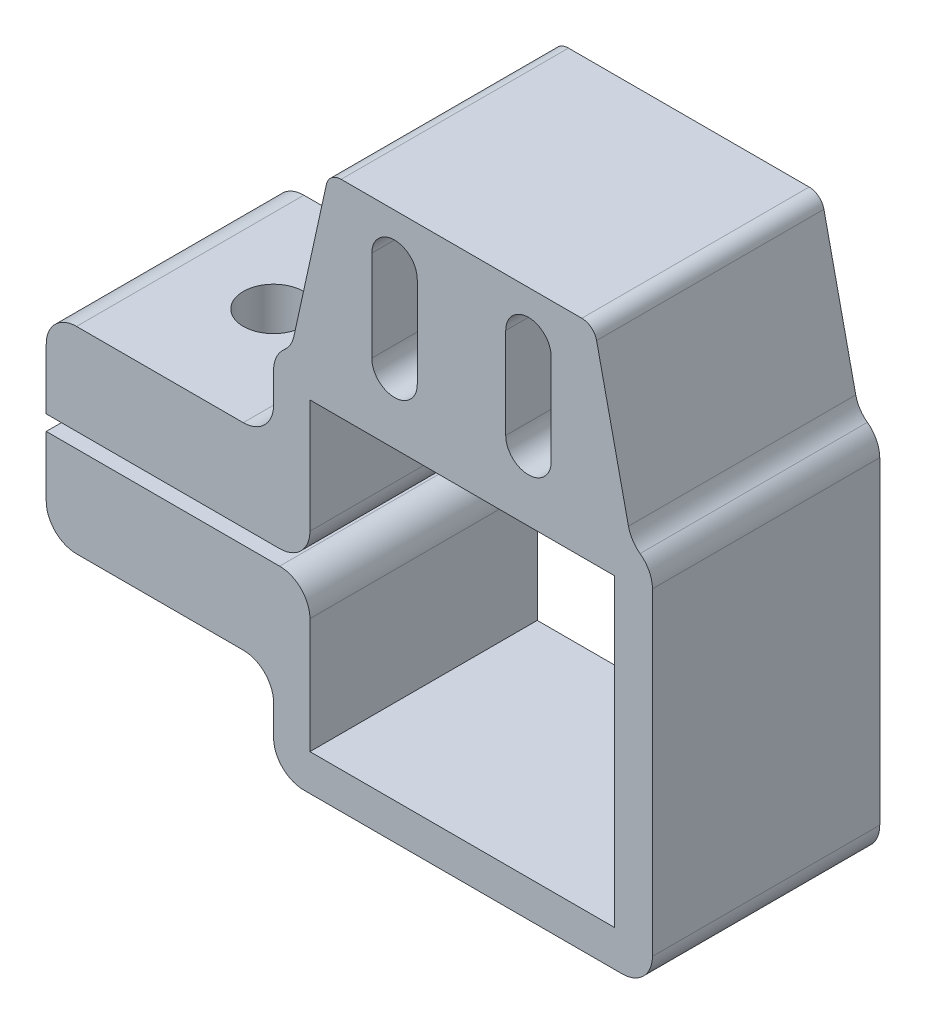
ISO-10303-21;
HEADER;
FILE_DESCRIPTION(('STEP AP214'),'2;1');
FILE_NAME('part.step','',(''),(''),'','','');
FILE_SCHEMA(('AUTOMOTIVE_DESIGN { 1 0 10303 214 1 1 1 1 }'));
ENDSEC;
DATA;
#1=APPLICATION_CONTEXT('core data for automotive mechanical design processes');
#2=APPLICATION_PROTOCOL_DEFINITION('international standard','automotive_design',2000,#1);
#3=PRODUCT_CONTEXT('',#1,'mechanical');
#4=PRODUCT('Part','Part','',(#3));
#5=PRODUCT_RELATED_PRODUCT_CATEGORY('part','',(#4));
#6=PRODUCT_DEFINITION_FORMATION('','',#4);
#7=PRODUCT_DEFINITION_CONTEXT('part definition',#1,'design');
#8=PRODUCT_DEFINITION('design','',#6,#7);
#9=PRODUCT_DEFINITION_SHAPE('','',#8);
#10=(LENGTH_UNIT() NAMED_UNIT(*) SI_UNIT(.MILLI.,.METRE.));
#11=(NAMED_UNIT(*) PLANE_ANGLE_UNIT() SI_UNIT($,.RADIAN.));
#12=(NAMED_UNIT(*) SI_UNIT($,.STERADIAN.) SOLID_ANGLE_UNIT());
#13=UNCERTAINTY_MEASURE_WITH_UNIT(LENGTH_MEASURE(1.E-05),#10,'distance_accuracy_value','');
#14=(GEOMETRIC_REPRESENTATION_CONTEXT(3) GLOBAL_UNCERTAINTY_ASSIGNED_CONTEXT((#13)) GLOBAL_UNIT_ASSIGNED_CONTEXT((#10,
#11,#12)) REPRESENTATION_CONTEXT('',''));
#15=CARTESIAN_POINT('',(0.,0.,0.));
#16=DIRECTION('',(0.,0.,1.));
#17=DIRECTION('',(1.,0.,0.));
#18=AXIS2_PLACEMENT_3D('',#15,#16,#17);
#19=CARTESIAN_POINT('',(215.342156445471,5.19858037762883,15.));
#20=DIRECTION('',(0.,0.,1.));
#21=DIRECTION('',(1.,0.,0.));
#22=AXIS2_PLACEMENT_3D('',#19,#20,#21);
#23=PLANE('',#22);
#24=DIRECTION('',(0.,-1.,0.));
#25=VECTOR('',#24,1.);
#26=CARTESIAN_POINT('',(221.423521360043,23.1264850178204,15.));
#27=LINE('',#26,#25);
#28=CARTESIAN_POINT('',(221.423521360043,23.1264850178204,15.));
#29=VERTEX_POINT('',#28);
#30=CARTESIAN_POINT('',(221.423521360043,17.1264850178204,15.));
#31=VERTEX_POINT('',#30);
#32=EDGE_CURVE('E335',#29,#31,#27,.T.);
#33=ORIENTED_EDGE('',*,*,#32,.F.);
#34=CARTESIAN_POINT('',(222.923521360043,23.1264850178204,15.));
#35=DIRECTION('',(0.,0.,1.));
#36=DIRECTION('',(1.,0.,0.));
#37=AXIS2_PLACEMENT_3D('',#34,#35,#36);
#38=CIRCLE('',#37,1.5);
#39=CARTESIAN_POINT('',(224.423521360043,23.1264850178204,15.));
#40=VERTEX_POINT('',#39);
#41=EDGE_CURVE('E333',#40,#29,#38,.T.);
#42=ORIENTED_EDGE('',*,*,#41,.F.);
#43=DIRECTION('',(0.,1.,0.));
#44=VECTOR('',#43,1.);
#45=CARTESIAN_POINT('',(224.423521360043,23.1264850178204,15.));
#46=LINE('',#45,#44);
#47=CARTESIAN_POINT('',(224.423521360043,17.1264850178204,15.));
#48=VERTEX_POINT('',#47);
#49=EDGE_CURVE('E341',#48,#40,#46,.T.);
#50=ORIENTED_EDGE('',*,*,#49,.F.);
#51=CARTESIAN_POINT('',(222.923521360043,17.1264850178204,15.));
#52=DIRECTION('',(0.,0.,1.));
#53=DIRECTION('',(1.,0.,0.));
#54=AXIS2_PLACEMENT_3D('',#51,#52,#53);
#55=CIRCLE('',#54,1.5);
#56=EDGE_CURVE('E338',#31,#48,#55,.T.);
#57=ORIENTED_EDGE('',*,*,#56,.F.);
#58=EDGE_LOOP('',(#33,#42,#50,#57));
#59=FACE_BOUND('',#58,.T.);
#60=DIRECTION('',(0.,1.,0.));
#61=VECTOR('',#60,1.);
#62=CARTESIAN_POINT('',(217.342156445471,0.198580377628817,15.));
#63=LINE('',#62,#61);
#64=CARTESIAN_POINT('',(217.342156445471,-7.40141962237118,15.));
#65=VERTEX_POINT('',#64);
#66=CARTESIAN_POINT('',(217.342156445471,0.198580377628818,15.));
#67=VERTEX_POINT('',#66);
#68=EDGE_CURVE('E364',#65,#67,#63,.T.);
#69=ORIENTED_EDGE('',*,*,#68,.T.);
#70=CARTESIAN_POINT('',(215.342156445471,0.198580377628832,15.));
#71=DIRECTION('',(0.,0.,1.));
#72=DIRECTION('',(1.,0.,0.));
#73=AXIS2_PLACEMENT_3D('',#70,#71,#72);
#74=CIRCLE('',#73,2.);
#75=CARTESIAN_POINT('',(215.342156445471,2.19858037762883,15.));
#76=VERTEX_POINT('',#75);
#77=EDGE_CURVE('E367',#67,#76,#74,.T.);
#78=ORIENTED_EDGE('',*,*,#77,.T.);
#79=DIRECTION('',(-1.,0.,0.));
#80=VECTOR('',#79,1.);
#81=CARTESIAN_POINT('',(214.942156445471,2.19858037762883,15.));
#82=LINE('',#81,#80);
#83=CARTESIAN_POINT('',(199.942156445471,2.19858037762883,15.));
#84=VERTEX_POINT('',#83);
#85=EDGE_CURVE('E370',#76,#84,#82,.T.);
#86=ORIENTED_EDGE('',*,*,#85,.T.);
#87=DIRECTION('',(0.,-1.,0.));
#88=VECTOR('',#87,1.);
#89=CARTESIAN_POINT('',(199.942156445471,2.19858037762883,15.));
#90=LINE('',#89,#88);
#91=CARTESIAN_POINT('',(199.942156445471,-1.80141962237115,15.));
#92=VERTEX_POINT('',#91);
#93=EDGE_CURVE('E372',#84,#92,#90,.T.);
#94=ORIENTED_EDGE('',*,*,#93,.T.);
#95=CARTESIAN_POINT('',(201.942156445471,-1.80141962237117,15.));
#96=DIRECTION('',(0.,0.,1.));
#97=DIRECTION('',(-1.,0.,0.));
#98=AXIS2_PLACEMENT_3D('',#95,#96,#97);
#99=CIRCLE('',#98,2.);
#100=CARTESIAN_POINT('',(201.942156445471,-3.80141962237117,15.));
#101=VERTEX_POINT('',#100);
#102=EDGE_CURVE('E374',#92,#101,#99,.T.);
#103=ORIENTED_EDGE('',*,*,#102,.T.);
#104=DIRECTION('',(1.,0.,0.));
#105=VECTOR('',#104,1.);
#106=CARTESIAN_POINT('',(201.942156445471,-3.80141962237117,15.));
#107=LINE('',#106,#105);
#108=CARTESIAN_POINT('',(212.942156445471,-3.80141962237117,15.));
#109=VERTEX_POINT('',#108);
#110=EDGE_CURVE('E376',#101,#109,#107,.T.);
#111=ORIENTED_EDGE('',*,*,#110,.T.);
#112=CARTESIAN_POINT('',(212.942156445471,-5.80141962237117,15.));
#113=DIRECTION('',(0.,0.,-1.));
#114=DIRECTION('',(1.,0.,0.));
#115=AXIS2_PLACEMENT_3D('',#112,#113,#114);
#116=CIRCLE('',#115,2.);
#117=CARTESIAN_POINT('',(214.942156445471,-5.80141962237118,15.));
#118=VERTEX_POINT('',#117);
#119=EDGE_CURVE('E378',#109,#118,#116,.T.);
#120=ORIENTED_EDGE('',*,*,#119,.T.);
#121=DIRECTION('',(0.,-1.,0.));
#122=VECTOR('',#121,1.);
#123=CARTESIAN_POINT('',(214.942156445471,-7.80141962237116,15.));
#124=LINE('',#123,#122);
#125=CARTESIAN_POINT('',(214.942156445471,-7.80141962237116,15.));
#126=VERTEX_POINT('',#125);
#127=EDGE_CURVE('E380',#118,#126,#124,.T.);
#128=ORIENTED_EDGE('',*,*,#127,.T.);
#129=CARTESIAN_POINT('',(216.942156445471,-7.80141962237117,15.));
#130=DIRECTION('',(0.,0.,1.));
#131=DIRECTION('',(-1.,0.,0.));
#132=AXIS2_PLACEMENT_3D('',#129,#130,#131);
#133=CIRCLE('',#132,2.);
#134=CARTESIAN_POINT('',(216.942156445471,-9.80141962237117,15.));
#135=VERTEX_POINT('',#134);
#136=EDGE_CURVE('E382',#126,#135,#133,.T.);
#137=ORIENTED_EDGE('',*,*,#136,.T.);
#138=DIRECTION('',(1.,0.,0.));
#139=VECTOR('',#138,1.);
#140=CARTESIAN_POINT('',(237.942156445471,-9.80141962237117,15.));
#141=LINE('',#140,#139);
#142=CARTESIAN_POINT('',(237.942156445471,-9.80141962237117,15.));
#143=VERTEX_POINT('',#142);
#144=EDGE_CURVE('E384',#135,#143,#141,.T.);
#145=ORIENTED_EDGE('',*,*,#144,.T.);
#146=CARTESIAN_POINT('',(237.942156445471,-7.80141962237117,15.));
#147=DIRECTION('',(0.,0.,1.));
#148=DIRECTION('',(-1.,0.,0.));
#149=AXIS2_PLACEMENT_3D('',#146,#147,#148);
#150=CIRCLE('',#149,2.);
#151=CARTESIAN_POINT('',(239.942156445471,-7.80141962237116,15.));
#152=VERTEX_POINT('',#151);
#153=EDGE_CURVE('E386',#143,#152,#150,.T.);
#154=ORIENTED_EDGE('',*,*,#153,.T.);
#155=DIRECTION('',(0.,1.,0.));
#156=VECTOR('',#155,1.);
#157=CARTESIAN_POINT('',(239.942156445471,13.1985803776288,15.));
#158=LINE('',#157,#156);
#159=CARTESIAN_POINT('',(239.942156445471,13.1985803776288,15.));
#160=VERTEX_POINT('',#159);
#161=EDGE_CURVE('E388',#152,#160,#158,.T.);
#162=ORIENTED_EDGE('',*,*,#161,.T.);
#163=CARTESIAN_POINT('',(237.942156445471,13.1985803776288,15.));
#164=DIRECTION('',(0.,0.,1.));
#165=DIRECTION('',(-1.,0.,0.));
#166=AXIS2_PLACEMENT_3D('',#163,#164,#165);
#167=CIRCLE('',#166,2.00000000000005);
#168=CARTESIAN_POINT('',(239.127299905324,14.8096157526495,15.));
#169=VERTEX_POINT('',#168);
#170=EDGE_CURVE('E390',#160,#169,#167,.T.);
#171=ORIENTED_EDGE('',*,*,#170,.T.);
#172=CARTESIAN_POINT('',(240.312443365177,16.4206511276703,15.));
#173=DIRECTION('',(0.,0.,-1.));
#174=DIRECTION('',(-1.,0.,0.));
#175=AXIS2_PLACEMENT_3D('',#172,#173,#174);
#176=CIRCLE('',#175,1.99999999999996);
#177=CARTESIAN_POINT('',(238.359049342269,15.9914055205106,15.));
#178=VERTEX_POINT('',#177);
#179=EDGE_CURVE('E392',#169,#178,#176,.T.);
#180=ORIENTED_EDGE('',*,*,#179,.T.);
#181=DIRECTION('',(-0.214622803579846,0.97669701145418,0.));
#182=VECTOR('',#181,1.);
#183=CARTESIAN_POINT('',(238.359049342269,15.9914055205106,15.));
#184=LINE('',#183,#182);
#185=CARTESIAN_POINT('',(236.258581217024,25.5501332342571,15.));
#186=VERTEX_POINT('',#185);
#187=EDGE_CURVE('E394',#178,#186,#184,.T.);
#188=ORIENTED_EDGE('',*,*,#187,.T.);
#189=CARTESIAN_POINT('',(235.28188420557,25.3355104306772,15.));
#190=DIRECTION('',(0.,0.,1.));
#191=DIRECTION('',(1.,0.,0.));
#192=AXIS2_PLACEMENT_3D('',#189,#190,#191);
#193=CIRCLE('',#192,0.999999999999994);
#194=CARTESIAN_POINT('',(235.28188420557,26.3355104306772,15.));
#195=VERTEX_POINT('',#194);
#196=EDGE_CURVE('E396',#186,#195,#193,.T.);
#197=ORIENTED_EDGE('',*,*,#196,.T.);
#198=DIRECTION('',(-1.,0.,0.));
#199=VECTOR('',#198,1.);
#200=CARTESIAN_POINT('',(219.402428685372,26.3355104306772,15.));
#201=LINE('',#200,#199);
#202=CARTESIAN_POINT('',(219.402428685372,26.3355104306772,15.));
#203=VERTEX_POINT('',#202);
#204=EDGE_CURVE('E398',#195,#203,#201,.T.);
#205=ORIENTED_EDGE('',*,*,#204,.T.);
#206=CARTESIAN_POINT('',(219.402428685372,25.3355104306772,15.));
#207=DIRECTION('',(0.,0.,1.));
#208=DIRECTION('',(1.,0.,0.));
#209=AXIS2_PLACEMENT_3D('',#206,#207,#208);
#210=CIRCLE('',#209,0.999999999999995);
#211=CARTESIAN_POINT('',(218.425731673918,25.5501332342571,15.));
#212=VERTEX_POINT('',#211);
#213=EDGE_CURVE('E400',#203,#212,#210,.T.);
#214=ORIENTED_EDGE('',*,*,#213,.T.);
#215=DIRECTION('',(-0.214622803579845,-0.97669701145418,0.));
#216=VECTOR('',#215,1.);
#217=CARTESIAN_POINT('',(216.282787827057,15.7981086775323,15.));
#218=LINE('',#217,#216);
#219=CARTESIAN_POINT('',(216.282787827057,15.7981086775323,15.));
#220=VERTEX_POINT('',#219);
#221=EDGE_CURVE('E402',#212,#220,#218,.T.);
#222=ORIENTED_EDGE('',*,*,#221,.T.);
#223=CARTESIAN_POINT('',(214.329393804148,16.227354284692,15.));
#224=DIRECTION('',(0.,0.,-1.));
#225=DIRECTION('',(1.,0.,0.));
#226=AXIS2_PLACEMENT_3D('',#223,#224,#225);
#227=CIRCLE('',#226,2.00000000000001);
#228=CARTESIAN_POINT('',(215.63577512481,14.7129673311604,15.));
#229=VERTEX_POINT('',#228);
#230=EDGE_CURVE('E404',#220,#229,#227,.T.);
#231=ORIENTED_EDGE('',*,*,#230,.T.);
#232=CARTESIAN_POINT('',(216.942156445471,13.1985803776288,15.));
#233=DIRECTION('',(0.,0.,1.));
#234=DIRECTION('',(-1.,0.,0.));
#235=AXIS2_PLACEMENT_3D('',#232,#233,#234);
#236=CIRCLE('',#235,2.);
#237=CARTESIAN_POINT('',(214.942156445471,13.1985803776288,15.));
#238=VERTEX_POINT('',#237);
#239=EDGE_CURVE('E406',#229,#238,#236,.T.);
#240=ORIENTED_EDGE('',*,*,#239,.T.);
#241=DIRECTION('',(0.,-1.,0.));
#242=VECTOR('',#241,1.);
#243=CARTESIAN_POINT('',(214.942156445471,11.1985803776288,15.));
#244=LINE('',#243,#242);
#245=CARTESIAN_POINT('',(214.942156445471,11.1985803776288,15.));
#246=VERTEX_POINT('',#245);
#247=EDGE_CURVE('E408',#238,#246,#244,.T.);
#248=ORIENTED_EDGE('',*,*,#247,.T.);
#249=CARTESIAN_POINT('',(212.942156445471,11.1985803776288,15.));
#250=DIRECTION('',(0.,0.,-1.));
#251=DIRECTION('',(-1.,0.,0.));
#252=AXIS2_PLACEMENT_3D('',#249,#250,#251);
#253=CIRCLE('',#252,2.);
#254=CARTESIAN_POINT('',(212.942156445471,9.19858037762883,15.));
#255=VERTEX_POINT('',#254);
#256=EDGE_CURVE('E410',#246,#255,#253,.T.);
#257=ORIENTED_EDGE('',*,*,#256,.T.);
#258=DIRECTION('',(-1.,0.,0.));
#259=VECTOR('',#258,1.);
#260=CARTESIAN_POINT('',(212.942156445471,9.19858037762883,15.));
#261=LINE('',#260,#259);
#262=CARTESIAN_POINT('',(201.942156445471,9.19858037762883,15.));
#263=VERTEX_POINT('',#262);
#264=EDGE_CURVE('E412',#255,#263,#261,.T.);
#265=ORIENTED_EDGE('',*,*,#264,.T.);
#266=CARTESIAN_POINT('',(201.942156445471,7.19858037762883,15.));
#267=DIRECTION('',(0.,0.,1.));
#268=DIRECTION('',(1.,0.,0.));
#269=AXIS2_PLACEMENT_3D('',#266,#267,#268);
#270=CIRCLE('',#269,2.);
#271=CARTESIAN_POINT('',(199.942156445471,7.19858037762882,15.));
#272=VERTEX_POINT('',#271);
#273=EDGE_CURVE('E414',#263,#272,#270,.T.);
#274=ORIENTED_EDGE('',*,*,#273,.T.);
#275=DIRECTION('',(0.,-1.,0.));
#276=VECTOR('',#275,1.);
#277=CARTESIAN_POINT('',(199.942156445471,7.19858037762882,15.));
#278=LINE('',#277,#276);
#279=CARTESIAN_POINT('',(199.942156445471,3.19901627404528,15.));
#280=VERTEX_POINT('',#279);
#281=EDGE_CURVE('E416',#272,#280,#278,.T.);
#282=ORIENTED_EDGE('',*,*,#281,.T.);
#283=DIRECTION('',(0.999999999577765,-2.90597610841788E-05,0.));
#284=VECTOR('',#283,1.);
#285=CARTESIAN_POINT('',(199.942156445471,3.19901627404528,15.));
#286=LINE('',#285,#284);
#287=CARTESIAN_POINT('',(214.942156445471,3.19858037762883,15.));
#288=VERTEX_POINT('',#287);
#289=EDGE_CURVE('E418',#280,#288,#286,.T.);
#290=ORIENTED_EDGE('',*,*,#289,.T.);
#291=DIRECTION('',(1.,0.,0.));
#292=VECTOR('',#291,1.);
#293=CARTESIAN_POINT('',(214.942156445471,3.19858037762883,15.));
#294=LINE('',#293,#292);
#295=CARTESIAN_POINT('',(215.342156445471,3.19858037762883,15.));
#296=VERTEX_POINT('',#295);
#297=EDGE_CURVE('E420',#288,#296,#294,.T.);
#298=ORIENTED_EDGE('',*,*,#297,.T.);
#299=CARTESIAN_POINT('',(215.342156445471,5.19858037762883,15.));
#300=DIRECTION('',(0.,0.,1.));
#301=DIRECTION('',(1.,0.,0.));
#302=AXIS2_PLACEMENT_3D('',#299,#300,#301);
#303=CIRCLE('',#302,2.);
#304=CARTESIAN_POINT('',(217.342156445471,5.19858037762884,15.));
#305=VERTEX_POINT('',#304);
#306=EDGE_CURVE('E422',#296,#305,#303,.T.);
#307=ORIENTED_EDGE('',*,*,#306,.T.);
#308=DIRECTION('',(0.,1.,0.));
#309=VECTOR('',#308,1.);
#310=CARTESIAN_POINT('',(217.342156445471,12.6985803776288,15.));
#311=LINE('',#310,#309);
#312=CARTESIAN_POINT('',(217.342156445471,12.6985803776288,15.));
#313=VERTEX_POINT('',#312);
#314=EDGE_CURVE('E424',#305,#313,#311,.T.);
#315=ORIENTED_EDGE('',*,*,#314,.T.);
#316=DIRECTION('',(1.,0.,0.));
#317=VECTOR('',#316,1.);
#318=CARTESIAN_POINT('',(237.442156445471,12.6985803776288,15.));
#319=LINE('',#318,#317);
#320=CARTESIAN_POINT('',(237.442156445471,12.6985803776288,15.));
#321=VERTEX_POINT('',#320);
#322=EDGE_CURVE('E426',#313,#321,#319,.T.);
#323=ORIENTED_EDGE('',*,*,#322,.T.);
#324=DIRECTION('',(0.,-1.,0.));
#325=VECTOR('',#324,1.);
#326=CARTESIAN_POINT('',(237.442156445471,-7.40141962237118,15.));
#327=LINE('',#326,#325);
#328=CARTESIAN_POINT('',(237.442156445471,-7.40141962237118,15.));
#329=VERTEX_POINT('',#328);
#330=EDGE_CURVE('E428',#321,#329,#327,.T.);
#331=ORIENTED_EDGE('',*,*,#330,.T.);
#332=DIRECTION('',(-1.,0.,0.));
#333=VECTOR('',#332,1.);
#334=CARTESIAN_POINT('',(217.342156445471,-7.40141962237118,15.));
#335=LINE('',#334,#333);
#336=EDGE_CURVE('E430',#329,#65,#335,.T.);
#337=ORIENTED_EDGE('',*,*,#336,.T.);
#338=EDGE_LOOP('',(#69,#78,#86,#94,#103,#111,#120,#128,#137,#145,#154,#162,#171,#180,#188,#197,
#205,#214,#222,#231,#240,#248,#257,#265,#274,#282,#290,#298,#307,#315,#323,#331,#337));
#339=FACE_BOUND('',#338,.T.);
#340=DIRECTION('',(0.,-1.,0.));
#341=VECTOR('',#340,1.);
#342=CARTESIAN_POINT('',(230.2607915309,23.1264850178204,15.));
#343=LINE('',#342,#341);
#344=CARTESIAN_POINT('',(230.2607915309,23.1264850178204,15.));
#345=VERTEX_POINT('',#344);
#346=CARTESIAN_POINT('',(230.2607915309,17.1264850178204,15.));
#347=VERTEX_POINT('',#346);
#348=EDGE_CURVE('E303',#345,#347,#343,.T.);
#349=ORIENTED_EDGE('',*,*,#348,.F.);
#350=CARTESIAN_POINT('',(231.7607915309,23.1264850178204,15.));
#351=DIRECTION('',(0.,0.,1.));
#352=DIRECTION('',(-1.,0.,0.));
#353=AXIS2_PLACEMENT_3D('',#350,#351,#352);
#354=CIRCLE('',#353,1.5);
#355=CARTESIAN_POINT('',(233.2607915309,23.1264850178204,15.));
#356=VERTEX_POINT('',#355);
#357=EDGE_CURVE('E295',#356,#345,#354,.T.);
#358=ORIENTED_EDGE('',*,*,#357,.F.);
#359=DIRECTION('',(0.,1.,0.));
#360=VECTOR('',#359,1.);
#361=CARTESIAN_POINT('',(233.2607915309,23.1264850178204,15.));
#362=LINE('',#361,#360);
#363=CARTESIAN_POINT('',(233.2607915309,17.1264850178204,15.));
#364=VERTEX_POINT('',#363);
#365=EDGE_CURVE('E317',#364,#356,#362,.T.);
#366=ORIENTED_EDGE('',*,*,#365,.F.);
#367=CARTESIAN_POINT('',(231.7607915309,17.1264850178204,15.));
#368=DIRECTION('',(0.,0.,1.));
#369=DIRECTION('',(-1.,0.,0.));
#370=AXIS2_PLACEMENT_3D('',#367,#368,#369);
#371=CIRCLE('',#370,1.5);
#372=EDGE_CURVE('E315',#347,#364,#371,.T.);
#373=ORIENTED_EDGE('',*,*,#372,.F.);
#374=EDGE_LOOP('',(#349,#358,#366,#373));
#375=FACE_BOUND('',#374,.T.);
#376=ADVANCED_FACE('F31',(#59,#339,#375),#23,.T.);
#377=CARTESIAN_POINT('',(215.342156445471,5.19858037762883,0.));
#378=DIRECTION('',(0.,0.,1.));
#379=DIRECTION('',(1.,0.,0.));
#380=AXIS2_PLACEMENT_3D('',#377,#378,#379);
#381=PLANE('',#380);
#382=CARTESIAN_POINT('',(222.923521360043,23.1264850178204,0.));
#383=DIRECTION('',(0.,0.,1.));
#384=DIRECTION('',(1.,0.,0.));
#385=AXIS2_PLACEMENT_3D('',#382,#383,#384);
#386=CIRCLE('',#385,1.5);
#387=CARTESIAN_POINT('',(224.423521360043,23.1264850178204,0.));
#388=VERTEX_POINT('',#387);
#389=CARTESIAN_POINT('',(221.423521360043,23.1264850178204,0.));
#390=VERTEX_POINT('',#389);
#391=EDGE_CURVE('E311',#388,#390,#386,.T.);
#392=ORIENTED_EDGE('',*,*,#391,.T.);
#393=DIRECTION('',(0.,-1.,0.));
#394=VECTOR('',#393,1.);
#395=CARTESIAN_POINT('',(221.423521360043,23.1264850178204,0.));
#396=LINE('',#395,#394);
#397=CARTESIAN_POINT('',(221.423521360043,17.1264850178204,0.));
#398=VERTEX_POINT('',#397);
#399=EDGE_CURVE('E346',#390,#398,#396,.T.);
#400=ORIENTED_EDGE('',*,*,#399,.T.);
#401=CARTESIAN_POINT('',(222.923521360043,17.1264850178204,0.));
#402=DIRECTION('',(0.,0.,1.));
#403=DIRECTION('',(1.,0.,0.));
#404=AXIS2_PLACEMENT_3D('',#401,#402,#403);
#405=CIRCLE('',#404,1.5);
#406=CARTESIAN_POINT('',(224.423521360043,17.1264850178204,0.));
#407=VERTEX_POINT('',#406);
#408=EDGE_CURVE('E349',#398,#407,#405,.T.);
#409=ORIENTED_EDGE('',*,*,#408,.T.);
#410=DIRECTION('',(0.,1.,0.));
#411=VECTOR('',#410,1.);
#412=CARTESIAN_POINT('',(224.423521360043,23.1264850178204,0.));
#413=LINE('',#412,#411);
#414=EDGE_CURVE('E336',#407,#388,#413,.T.);
#415=ORIENTED_EDGE('',*,*,#414,.T.);
#416=EDGE_LOOP('',(#392,#400,#409,#415));
#417=FACE_BOUND('',#416,.T.);
#418=DIRECTION('',(0.,1.,0.));
#419=VECTOR('',#418,1.);
#420=CARTESIAN_POINT('',(217.342156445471,0.198580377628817,0.));
#421=LINE('',#420,#419);
#422=CARTESIAN_POINT('',(217.342156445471,-7.40141962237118,0.));
#423=VERTEX_POINT('',#422);
#424=CARTESIAN_POINT('',(217.342156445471,0.198580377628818,0.));
#425=VERTEX_POINT('',#424);
#426=EDGE_CURVE('E363',#423,#425,#421,.T.);
#427=ORIENTED_EDGE('',*,*,#426,.F.);
#428=DIRECTION('',(-1.,0.,0.));
#429=VECTOR('',#428,1.);
#430=CARTESIAN_POINT('',(217.342156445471,-7.40141962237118,0.));
#431=LINE('',#430,#429);
#432=CARTESIAN_POINT('',(237.442156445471,-7.40141962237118,0.));
#433=VERTEX_POINT('',#432);
#434=EDGE_CURVE('E368',#433,#423,#431,.T.);
#435=ORIENTED_EDGE('',*,*,#434,.F.);
#436=DIRECTION('',(0.,-1.,0.));
#437=VECTOR('',#436,1.);
#438=CARTESIAN_POINT('',(237.442156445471,-7.40141962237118,0.));
#439=LINE('',#438,#437);
#440=CARTESIAN_POINT('',(237.442156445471,12.6985803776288,0.));
#441=VERTEX_POINT('',#440);
#442=EDGE_CURVE('E496',#441,#433,#439,.T.);
#443=ORIENTED_EDGE('',*,*,#442,.F.);
#444=DIRECTION('',(1.,0.,0.));
#445=VECTOR('',#444,1.);
#446=CARTESIAN_POINT('',(237.442156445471,12.6985803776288,0.));
#447=LINE('',#446,#445);
#448=CARTESIAN_POINT('',(217.342156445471,12.6985803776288,0.));
#449=VERTEX_POINT('',#448);
#450=EDGE_CURVE('E494',#449,#441,#447,.T.);
#451=ORIENTED_EDGE('',*,*,#450,.F.);
#452=DIRECTION('',(0.,1.,0.));
#453=VECTOR('',#452,1.);
#454=CARTESIAN_POINT('',(217.342156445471,12.6985803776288,0.));
#455=LINE('',#454,#453);
#456=CARTESIAN_POINT('',(217.342156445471,5.19858037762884,0.));
#457=VERTEX_POINT('',#456);
#458=EDGE_CURVE('E492',#457,#449,#455,.T.);
#459=ORIENTED_EDGE('',*,*,#458,.F.);
#460=CARTESIAN_POINT('',(215.342156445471,5.19858037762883,0.));
#461=DIRECTION('',(0.,0.,1.));
#462=DIRECTION('',(1.,0.,0.));
#463=AXIS2_PLACEMENT_3D('',#460,#461,#462);
#464=CIRCLE('',#463,2.);
#465=CARTESIAN_POINT('',(215.342156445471,3.19858037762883,0.));
#466=VERTEX_POINT('',#465);
#467=EDGE_CURVE('E490',#466,#457,#464,.T.);
#468=ORIENTED_EDGE('',*,*,#467,.F.);
#469=DIRECTION('',(1.,0.,0.));
#470=VECTOR('',#469,1.);
#471=CARTESIAN_POINT('',(214.942156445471,3.19858037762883,0.));
#472=LINE('',#471,#470);
#473=CARTESIAN_POINT('',(214.942156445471,3.19858037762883,0.));
#474=VERTEX_POINT('',#473);
#475=EDGE_CURVE('E488',#474,#466,#472,.T.);
#476=ORIENTED_EDGE('',*,*,#475,.F.);
#477=DIRECTION('',(0.999999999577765,-2.90597610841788E-05,0.));
#478=VECTOR('',#477,1.);
#479=CARTESIAN_POINT('',(199.942156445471,3.19901627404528,0.));
#480=LINE('',#479,#478);
#481=CARTESIAN_POINT('',(199.942156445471,3.19901627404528,0.));
#482=VERTEX_POINT('',#481);
#483=EDGE_CURVE('E486',#482,#474,#480,.T.);
#484=ORIENTED_EDGE('',*,*,#483,.F.);
#485=DIRECTION('',(0.,-1.,0.));
#486=VECTOR('',#485,1.);
#487=CARTESIAN_POINT('',(199.942156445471,7.19858037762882,0.));
#488=LINE('',#487,#486);
#489=CARTESIAN_POINT('',(199.942156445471,7.19858037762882,0.));
#490=VERTEX_POINT('',#489);
#491=EDGE_CURVE('E484',#490,#482,#488,.T.);
#492=ORIENTED_EDGE('',*,*,#491,.F.);
#493=CARTESIAN_POINT('',(201.942156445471,7.19858037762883,0.));
#494=DIRECTION('',(0.,0.,1.));
#495=DIRECTION('',(1.,0.,0.));
#496=AXIS2_PLACEMENT_3D('',#493,#494,#495);
#497=CIRCLE('',#496,2.);
#498=CARTESIAN_POINT('',(201.942156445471,9.19858037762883,0.));
#499=VERTEX_POINT('',#498);
#500=EDGE_CURVE('E482',#499,#490,#497,.T.);
#501=ORIENTED_EDGE('',*,*,#500,.F.);
#502=DIRECTION('',(-1.,0.,0.));
#503=VECTOR('',#502,1.);
#504=CARTESIAN_POINT('',(212.942156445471,9.19858037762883,0.));
#505=LINE('',#504,#503);
#506=CARTESIAN_POINT('',(212.942156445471,9.19858037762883,0.));
#507=VERTEX_POINT('',#506);
#508=EDGE_CURVE('E480',#507,#499,#505,.T.);
#509=ORIENTED_EDGE('',*,*,#508,.F.);
#510=CARTESIAN_POINT('',(212.942156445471,11.1985803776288,0.));
#511=DIRECTION('',(0.,0.,-1.));
#512=DIRECTION('',(-1.,0.,0.));
#513=AXIS2_PLACEMENT_3D('',#510,#511,#512);
#514=CIRCLE('',#513,2.);
#515=CARTESIAN_POINT('',(214.942156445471,11.1985803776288,0.));
#516=VERTEX_POINT('',#515);
#517=EDGE_CURVE('E478',#516,#507,#514,.T.);
#518=ORIENTED_EDGE('',*,*,#517,.F.);
#519=DIRECTION('',(0.,-1.,0.));
#520=VECTOR('',#519,1.);
#521=CARTESIAN_POINT('',(214.942156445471,11.1985803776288,0.));
#522=LINE('',#521,#520);
#523=CARTESIAN_POINT('',(214.942156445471,13.1985803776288,0.));
#524=VERTEX_POINT('',#523);
#525=EDGE_CURVE('E476',#524,#516,#522,.T.);
#526=ORIENTED_EDGE('',*,*,#525,.F.);
#527=CARTESIAN_POINT('',(216.942156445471,13.1985803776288,0.));
#528=DIRECTION('',(0.,0.,1.));
#529=DIRECTION('',(-1.,0.,0.));
#530=AXIS2_PLACEMENT_3D('',#527,#528,#529);
#531=CIRCLE('',#530,2.);
#532=CARTESIAN_POINT('',(215.63577512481,14.7129673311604,0.));
#533=VERTEX_POINT('',#532);
#534=EDGE_CURVE('E474',#533,#524,#531,.T.);
#535=ORIENTED_EDGE('',*,*,#534,.F.);
#536=CARTESIAN_POINT('',(214.329393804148,16.227354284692,0.));
#537=DIRECTION('',(0.,0.,-1.));
#538=DIRECTION('',(1.,0.,0.));
#539=AXIS2_PLACEMENT_3D('',#536,#537,#538);
#540=CIRCLE('',#539,2.00000000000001);
#541=CARTESIAN_POINT('',(216.282787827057,15.7981086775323,0.));
#542=VERTEX_POINT('',#541);
#543=EDGE_CURVE('E472',#542,#533,#540,.T.);
#544=ORIENTED_EDGE('',*,*,#543,.F.);
#545=DIRECTION('',(-0.214622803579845,-0.97669701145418,0.));
#546=VECTOR('',#545,1.);
#547=CARTESIAN_POINT('',(216.282787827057,15.7981086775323,0.));
#548=LINE('',#547,#546);
#549=CARTESIAN_POINT('',(218.425731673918,25.5501332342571,0.));
#550=VERTEX_POINT('',#549);
#551=EDGE_CURVE('E470',#550,#542,#548,.T.);
#552=ORIENTED_EDGE('',*,*,#551,.F.);
#553=CARTESIAN_POINT('',(219.402428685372,25.3355104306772,0.));
#554=DIRECTION('',(0.,0.,1.));
#555=DIRECTION('',(1.,0.,0.));
#556=AXIS2_PLACEMENT_3D('',#553,#554,#555);
#557=CIRCLE('',#556,0.999999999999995);
#558=CARTESIAN_POINT('',(219.402428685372,26.3355104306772,0.));
#559=VERTEX_POINT('',#558);
#560=EDGE_CURVE('E468',#559,#550,#557,.T.);
#561=ORIENTED_EDGE('',*,*,#560,.F.);
#562=DIRECTION('',(-1.,0.,0.));
#563=VECTOR('',#562,1.);
#564=CARTESIAN_POINT('',(219.402428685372,26.3355104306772,0.));
#565=LINE('',#564,#563);
#566=CARTESIAN_POINT('',(235.28188420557,26.3355104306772,0.));
#567=VERTEX_POINT('',#566);
#568=EDGE_CURVE('E466',#567,#559,#565,.T.);
#569=ORIENTED_EDGE('',*,*,#568,.F.);
#570=CARTESIAN_POINT('',(235.28188420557,25.3355104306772,0.));
#571=DIRECTION('',(0.,0.,1.));
#572=DIRECTION('',(1.,0.,0.));
#573=AXIS2_PLACEMENT_3D('',#570,#571,#572);
#574=CIRCLE('',#573,0.999999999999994);
#575=CARTESIAN_POINT('',(236.258581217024,25.5501332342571,0.));
#576=VERTEX_POINT('',#575);
#577=EDGE_CURVE('E464',#576,#567,#574,.T.);
#578=ORIENTED_EDGE('',*,*,#577,.F.);
#579=DIRECTION('',(-0.214622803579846,0.97669701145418,0.));
#580=VECTOR('',#579,1.);
#581=CARTESIAN_POINT('',(238.359049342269,15.9914055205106,0.));
#582=LINE('',#581,#580);
#583=CARTESIAN_POINT('',(238.359049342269,15.9914055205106,0.));
#584=VERTEX_POINT('',#583);
#585=EDGE_CURVE('E462',#584,#576,#582,.T.);
#586=ORIENTED_EDGE('',*,*,#585,.F.);
#587=CARTESIAN_POINT('',(240.312443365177,16.4206511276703,0.));
#588=DIRECTION('',(0.,0.,-1.));
#589=DIRECTION('',(-1.,0.,0.));
#590=AXIS2_PLACEMENT_3D('',#587,#588,#589);
#591=CIRCLE('',#590,1.99999999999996);
#592=CARTESIAN_POINT('',(239.127299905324,14.8096157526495,0.));
#593=VERTEX_POINT('',#592);
#594=EDGE_CURVE('E460',#593,#584,#591,.T.);
#595=ORIENTED_EDGE('',*,*,#594,.F.);
#596=CARTESIAN_POINT('',(237.942156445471,13.1985803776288,0.));
#597=DIRECTION('',(0.,0.,1.));
#598=DIRECTION('',(-1.,0.,0.));
#599=AXIS2_PLACEMENT_3D('',#596,#597,#598);
#600=CIRCLE('',#599,2.00000000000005);
#601=CARTESIAN_POINT('',(239.942156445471,13.1985803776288,0.));
#602=VERTEX_POINT('',#601);
#603=EDGE_CURVE('E458',#602,#593,#600,.T.);
#604=ORIENTED_EDGE('',*,*,#603,.F.);
#605=DIRECTION('',(0.,1.,0.));
#606=VECTOR('',#605,1.);
#607=CARTESIAN_POINT('',(239.942156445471,13.1985803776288,0.));
#608=LINE('',#607,#606);
#609=CARTESIAN_POINT('',(239.942156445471,-7.80141962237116,0.));
#610=VERTEX_POINT('',#609);
#611=EDGE_CURVE('E456',#610,#602,#608,.T.);
#612=ORIENTED_EDGE('',*,*,#611,.F.);
#613=CARTESIAN_POINT('',(237.942156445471,-7.80141962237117,0.));
#614=DIRECTION('',(0.,0.,1.));
#615=DIRECTION('',(-1.,0.,0.));
#616=AXIS2_PLACEMENT_3D('',#613,#614,#615);
#617=CIRCLE('',#616,2.);
#618=CARTESIAN_POINT('',(237.942156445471,-9.80141962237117,0.));
#619=VERTEX_POINT('',#618);
#620=EDGE_CURVE('E454',#619,#610,#617,.T.);
#621=ORIENTED_EDGE('',*,*,#620,.F.);
#622=DIRECTION('',(1.,0.,0.));
#623=VECTOR('',#622,1.);
#624=CARTESIAN_POINT('',(237.942156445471,-9.80141962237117,0.));
#625=LINE('',#624,#623);
#626=CARTESIAN_POINT('',(216.942156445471,-9.80141962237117,0.));
#627=VERTEX_POINT('',#626);
#628=EDGE_CURVE('E452',#627,#619,#625,.T.);
#629=ORIENTED_EDGE('',*,*,#628,.F.);
#630=CARTESIAN_POINT('',(216.942156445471,-7.80141962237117,0.));
#631=DIRECTION('',(0.,0.,1.));
#632=DIRECTION('',(-1.,0.,0.));
#633=AXIS2_PLACEMENT_3D('',#630,#631,#632);
#634=CIRCLE('',#633,2.);
#635=CARTESIAN_POINT('',(214.942156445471,-7.80141962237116,0.));
#636=VERTEX_POINT('',#635);
#637=EDGE_CURVE('E450',#636,#627,#634,.T.);
#638=ORIENTED_EDGE('',*,*,#637,.F.);
#639=DIRECTION('',(0.,-1.,0.));
#640=VECTOR('',#639,1.);
#641=CARTESIAN_POINT('',(214.942156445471,-7.80141962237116,0.));
#642=LINE('',#641,#640);
#643=CARTESIAN_POINT('',(214.942156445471,-5.80141962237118,0.));
#644=VERTEX_POINT('',#643);
#645=EDGE_CURVE('E448',#644,#636,#642,.T.);
#646=ORIENTED_EDGE('',*,*,#645,.F.);
#647=CARTESIAN_POINT('',(212.942156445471,-5.80141962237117,0.));
#648=DIRECTION('',(0.,0.,-1.));
#649=DIRECTION('',(1.,0.,0.));
#650=AXIS2_PLACEMENT_3D('',#647,#648,#649);
#651=CIRCLE('',#650,2.);
#652=CARTESIAN_POINT('',(212.942156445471,-3.80141962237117,0.));
#653=VERTEX_POINT('',#652);
#654=EDGE_CURVE('E446',#653,#644,#651,.T.);
#655=ORIENTED_EDGE('',*,*,#654,.F.);
#656=DIRECTION('',(1.,0.,0.));
#657=VECTOR('',#656,1.);
#658=CARTESIAN_POINT('',(201.942156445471,-3.80141962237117,0.));
#659=LINE('',#658,#657);
#660=CARTESIAN_POINT('',(201.942156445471,-3.80141962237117,0.));
#661=VERTEX_POINT('',#660);
#662=EDGE_CURVE('E444',#661,#653,#659,.T.);
#663=ORIENTED_EDGE('',*,*,#662,.F.);
#664=CARTESIAN_POINT('',(201.942156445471,-1.80141962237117,0.));
#665=DIRECTION('',(0.,0.,1.));
#666=DIRECTION('',(-1.,0.,0.));
#667=AXIS2_PLACEMENT_3D('',#664,#665,#666);
#668=CIRCLE('',#667,2.);
#669=CARTESIAN_POINT('',(199.942156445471,-1.80141962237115,0.));
#670=VERTEX_POINT('',#669);
#671=EDGE_CURVE('E442',#670,#661,#668,.T.);
#672=ORIENTED_EDGE('',*,*,#671,.F.);
#673=DIRECTION('',(0.,-1.,0.));
#674=VECTOR('',#673,1.);
#675=CARTESIAN_POINT('',(199.942156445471,2.19858037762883,0.));
#676=LINE('',#675,#674);
#677=CARTESIAN_POINT('',(199.942156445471,2.19858037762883,0.));
#678=VERTEX_POINT('',#677);
#679=EDGE_CURVE('E440',#678,#670,#676,.T.);
#680=ORIENTED_EDGE('',*,*,#679,.F.);
#681=DIRECTION('',(-1.,0.,0.));
#682=VECTOR('',#681,1.);
#683=CARTESIAN_POINT('',(199.942156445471,2.19858037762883,0.));
#684=LINE('',#683,#682);
#685=CARTESIAN_POINT('',(215.342156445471,2.19858037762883,0.));
#686=VERTEX_POINT('',#685);
#687=EDGE_CURVE('E438',#686,#678,#684,.T.);
#688=ORIENTED_EDGE('',*,*,#687,.F.);
#689=CARTESIAN_POINT('',(215.342156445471,0.198580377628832,0.));
#690=DIRECTION('',(0.,0.,1.));
#691=DIRECTION('',(1.,0.,0.));
#692=AXIS2_PLACEMENT_3D('',#689,#690,#691);
#693=CIRCLE('',#692,2.);
#694=EDGE_CURVE('E435',#425,#686,#693,.T.);
#695=ORIENTED_EDGE('',*,*,#694,.F.);
#696=EDGE_LOOP('',(#427,#435,#443,#451,#459,#468,#476,#484,#492,#501,#509,#518,#526,#535,#544,
#552,#561,#569,#578,#586,#595,#604,#612,#621,#629,#638,#646,#655,#663,#672,#680,#688,#695));
#697=FACE_BOUND('',#696,.T.);
#698=CARTESIAN_POINT('',(231.7607915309,23.1264850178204,0.));
#699=DIRECTION('',(0.,0.,1.));
#700=DIRECTION('',(-1.,0.,0.));
#701=AXIS2_PLACEMENT_3D('',#698,#699,#700);
#702=CIRCLE('',#701,1.5);
#703=CARTESIAN_POINT('',(233.2607915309,23.1264850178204,0.));
#704=VERTEX_POINT('',#703);
#705=CARTESIAN_POINT('',(230.2607915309,23.1264850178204,0.));
#706=VERTEX_POINT('',#705);
#707=EDGE_CURVE('E55',#704,#706,#702,.T.);
#708=ORIENTED_EDGE('',*,*,#707,.T.);
#709=DIRECTION('',(0.,-1.,0.));
#710=VECTOR('',#709,1.);
#711=CARTESIAN_POINT('',(230.2607915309,23.1264850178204,0.));
#712=LINE('',#711,#710);
#713=CARTESIAN_POINT('',(230.2607915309,17.1264850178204,0.));
#714=VERTEX_POINT('',#713);
#715=EDGE_CURVE('E310',#706,#714,#712,.T.);
#716=ORIENTED_EDGE('',*,*,#715,.T.);
#717=CARTESIAN_POINT('',(231.7607915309,17.1264850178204,0.));
#718=DIRECTION('',(0.,0.,1.));
#719=DIRECTION('',(-1.,0.,0.));
#720=AXIS2_PLACEMENT_3D('',#717,#718,#719);
#721=CIRCLE('',#720,1.5);
#722=CARTESIAN_POINT('',(233.2607915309,17.1264850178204,0.));
#723=VERTEX_POINT('',#722);
#724=EDGE_CURVE('E325',#714,#723,#721,.T.);
#725=ORIENTED_EDGE('',*,*,#724,.T.);
#726=DIRECTION('',(0.,1.,0.));
#727=VECTOR('',#726,1.);
#728=CARTESIAN_POINT('',(233.2607915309,23.1264850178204,0.));
#729=LINE('',#728,#727);
#730=EDGE_CURVE('E304',#723,#704,#729,.T.);
#731=ORIENTED_EDGE('',*,*,#730,.T.);
#732=EDGE_LOOP('',(#708,#716,#725,#731));
#733=FACE_BOUND('',#732,.T.);
#734=ADVANCED_FACE('F602',(#417,#697,#733),#381,.F.);
#735=CARTESIAN_POINT('',(217.342156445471,0.198580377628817,15.));
#736=DIRECTION('',(-1.,0.,0.));
#737=DIRECTION('',(0.,0.,1.));
#738=AXIS2_PLACEMENT_3D('',#735,#736,#737);
#739=PLANE('',#738);
#740=ORIENTED_EDGE('',*,*,#426,.T.);
#741=DIRECTION('',(0.,0.,-1.));
#742=VECTOR('',#741,1.);
#743=CARTESIAN_POINT('',(217.342156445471,0.198580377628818,15.));
#744=LINE('',#743,#742);
#745=EDGE_CURVE('E11',#67,#425,#744,.T.);
#746=ORIENTED_EDGE('',*,*,#745,.F.);
#747=ORIENTED_EDGE('',*,*,#68,.F.);
#748=DIRECTION('',(0.,0.,-1.));
#749=VECTOR('',#748,1.);
#750=CARTESIAN_POINT('',(217.342156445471,-7.40141962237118,15.));
#751=LINE('',#750,#749);
#752=EDGE_CURVE('E432',#65,#423,#751,.T.);
#753=ORIENTED_EDGE('',*,*,#752,.T.);
#754=EDGE_LOOP('',(#740,#746,#747,#753));
#755=FACE_BOUND('',#754,.T.);
#756=ADVANCED_FACE('F33',(#755),#739,.F.);
#757=CARTESIAN_POINT('',(215.342156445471,0.198580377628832,15.));
#758=DIRECTION('',(0.,0.,-1.));
#759=DIRECTION('',(-1.,0.,0.));
#760=AXIS2_PLACEMENT_3D('',#757,#758,#759);
#761=CYLINDRICAL_SURFACE('',#760,2.);
#762=ORIENTED_EDGE('',*,*,#694,.T.);
#763=DIRECTION('',(0.,0.,-1.));
#764=VECTOR('',#763,1.);
#765=CARTESIAN_POINT('',(215.342156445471,2.19858037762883,15.));
#766=LINE('',#765,#764);
#767=EDGE_CURVE('E40',#76,#686,#766,.T.);
#768=ORIENTED_EDGE('',*,*,#767,.F.);
#769=ORIENTED_EDGE('',*,*,#77,.F.);
#770=ORIENTED_EDGE('',*,*,#745,.T.);
#771=EDGE_LOOP('',(#762,#768,#769,#770));
#772=FACE_BOUND('',#771,.T.);
#773=ADVANCED_FACE('F598',(#772),#761,.T.);
#774=CARTESIAN_POINT('',(199.942156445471,2.19858037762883,15.));
#775=DIRECTION('',(0.,-1.,0.));
#776=DIRECTION('',(1.,0.,0.));
#777=AXIS2_PLACEMENT_3D('',#774,#775,#776);
#778=PLANE('',#777);
#779=CARTESIAN_POINT('',(207.442156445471,2.19858037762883,7.5));
#780=DIRECTION('',(0.,-1.,0.));
#781=DIRECTION('',(1.,0.,0.));
#782=AXIS2_PLACEMENT_3D('',#779,#780,#781);
#783=CIRCLE('',#782,2.);
#784=CARTESIAN_POINT('',(209.442156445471,2.19858037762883,7.5));
#785=VERTEX_POINT('',#784);
#786=EDGE_CURVE('E323',#785,#785,#783,.T.);
#787=ORIENTED_EDGE('',*,*,#786,.T.);
#788=EDGE_LOOP('',(#787));
#789=FACE_BOUND('',#788,.T.);
#790=ORIENTED_EDGE('',*,*,#687,.T.);
#791=DIRECTION('',(0.,0.,-1.));
#792=VECTOR('',#791,1.);
#793=CARTESIAN_POINT('',(199.942156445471,2.19858037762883,15.));
#794=LINE('',#793,#792);
#795=EDGE_CURVE('E588',#84,#678,#794,.T.);
#796=ORIENTED_EDGE('',*,*,#795,.F.);
#797=ORIENTED_EDGE('',*,*,#85,.F.);
#798=ORIENTED_EDGE('',*,*,#767,.T.);
#799=EDGE_LOOP('',(#790,#796,#797,#798));
#800=FACE_BOUND('',#799,.T.);
#801=ADVANCED_FACE('F595',(#789,#800),#778,.F.);
#802=CARTESIAN_POINT('',(199.942156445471,2.19858037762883,15.));
#803=DIRECTION('',(1.,0.,0.));
#804=DIRECTION('',(0.,0.,-1.));
#805=AXIS2_PLACEMENT_3D('',#802,#803,#804);
#806=PLANE('',#805);
#807=ORIENTED_EDGE('',*,*,#679,.T.);
#808=DIRECTION('',(0.,0.,-1.));
#809=VECTOR('',#808,1.);
#810=CARTESIAN_POINT('',(199.942156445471,-1.80141962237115,15.));
#811=LINE('',#810,#809);
#812=EDGE_CURVE('E585',#92,#670,#811,.T.);
#813=ORIENTED_EDGE('',*,*,#812,.F.);
#814=ORIENTED_EDGE('',*,*,#93,.F.);
#815=ORIENTED_EDGE('',*,*,#795,.T.);
#816=EDGE_LOOP('',(#807,#813,#814,#815));
#817=FACE_BOUND('',#816,.T.);
#818=ADVANCED_FACE('F610',(#817),#806,.F.);
#819=CARTESIAN_POINT('',(201.942156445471,-1.80141962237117,15.));
#820=DIRECTION('',(0.,0.,-1.));
#821=DIRECTION('',(-1.,0.,0.));
#822=AXIS2_PLACEMENT_3D('',#819,#820,#821);
#823=CYLINDRICAL_SURFACE('',#822,2.);
#824=ORIENTED_EDGE('',*,*,#671,.T.);
#825=DIRECTION('',(0.,0.,-1.));
#826=VECTOR('',#825,1.);
#827=CARTESIAN_POINT('',(201.942156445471,-3.80141962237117,15.));
#828=LINE('',#827,#826);
#829=EDGE_CURVE('E582',#101,#661,#828,.T.);
#830=ORIENTED_EDGE('',*,*,#829,.F.);
#831=ORIENTED_EDGE('',*,*,#102,.F.);
#832=ORIENTED_EDGE('',*,*,#812,.T.);
#833=EDGE_LOOP('',(#824,#830,#831,#832));
#834=FACE_BOUND('',#833,.T.);
#835=ADVANCED_FACE('F614',(#834),#823,.T.);
#836=CARTESIAN_POINT('',(201.942156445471,-3.80141962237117,15.));
#837=DIRECTION('',(0.,1.,0.));
#838=DIRECTION('',(0.,0.,1.));
#839=AXIS2_PLACEMENT_3D('',#836,#837,#838);
#840=PLANE('',#839);
#841=CARTESIAN_POINT('',(207.442156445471,-3.80141962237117,7.5));
#842=DIRECTION('',(0.,1.,0.));
#843=DIRECTION('',(0.,0.,1.));
#844=AXIS2_PLACEMENT_3D('',#841,#842,#843);
#845=CIRCLE('',#844,2.);
#846=CARTESIAN_POINT('',(207.442156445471,-3.80141962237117,9.49999999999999));
#847=VERTEX_POINT('',#846);
#848=EDGE_CURVE('E1143',#847,#847,#845,.T.);
#849=ORIENTED_EDGE('',*,*,#848,.T.);
#850=EDGE_LOOP('',(#849));
#851=FACE_BOUND('',#850,.T.);
#852=ORIENTED_EDGE('',*,*,#662,.T.);
#853=DIRECTION('',(0.,0.,-1.));
#854=VECTOR('',#853,1.);
#855=CARTESIAN_POINT('',(212.942156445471,-3.80141962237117,15.));
#856=LINE('',#855,#854);
#857=EDGE_CURVE('E579',#109,#653,#856,.T.);
#858=ORIENTED_EDGE('',*,*,#857,.F.);
#859=ORIENTED_EDGE('',*,*,#110,.F.);
#860=ORIENTED_EDGE('',*,*,#829,.T.);
#861=EDGE_LOOP('',(#852,#858,#859,#860));
#862=FACE_BOUND('',#861,.T.);
#863=ADVANCED_FACE('F756',(#851,#862),#840,.F.);
#864=CARTESIAN_POINT('',(212.942156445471,-5.80141962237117,15.));
#865=DIRECTION('',(0.,0.,-1.));
#866=DIRECTION('',(-1.,0.,0.));
#867=AXIS2_PLACEMENT_3D('',#864,#865,#866);
#868=CYLINDRICAL_SURFACE('',#867,2.);
#869=ORIENTED_EDGE('',*,*,#654,.T.);
#870=DIRECTION('',(0.,0.,-1.));
#871=VECTOR('',#870,1.);
#872=CARTESIAN_POINT('',(214.942156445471,-5.80141962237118,15.));
#873=LINE('',#872,#871);
#874=EDGE_CURVE('E576',#118,#644,#873,.T.);
#875=ORIENTED_EDGE('',*,*,#874,.F.);
#876=ORIENTED_EDGE('',*,*,#119,.F.);
#877=ORIENTED_EDGE('',*,*,#857,.T.);
#878=EDGE_LOOP('',(#869,#875,#876,#877));
#879=FACE_BOUND('',#878,.T.);
#880=ADVANCED_FACE('F754',(#879),#868,.F.);
#881=CARTESIAN_POINT('',(214.942156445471,-7.80141962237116,15.));
#882=DIRECTION('',(1.,0.,0.));
#883=DIRECTION('',(0.,0.,-1.));
#884=AXIS2_PLACEMENT_3D('',#881,#882,#883);
#885=PLANE('',#884);
#886=ORIENTED_EDGE('',*,*,#645,.T.);
#887=DIRECTION('',(0.,0.,-1.));
#888=VECTOR('',#887,1.);
#889=CARTESIAN_POINT('',(214.942156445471,-7.80141962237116,15.));
#890=LINE('',#889,#888);
#891=EDGE_CURVE('E573',#126,#636,#890,.T.);
#892=ORIENTED_EDGE('',*,*,#891,.F.);
#893=ORIENTED_EDGE('',*,*,#127,.F.);
#894=ORIENTED_EDGE('',*,*,#874,.T.);
#895=EDGE_LOOP('',(#886,#892,#893,#894));
#896=FACE_BOUND('',#895,.T.);
#897=ADVANCED_FACE('F749',(#896),#885,.F.);
#898=CARTESIAN_POINT('',(216.942156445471,-7.80141962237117,15.));
#899=DIRECTION('',(0.,0.,-1.));
#900=DIRECTION('',(-1.,0.,0.));
#901=AXIS2_PLACEMENT_3D('',#898,#899,#900);
#902=CYLINDRICAL_SURFACE('',#901,2.);
#903=ORIENTED_EDGE('',*,*,#637,.T.);
#904=DIRECTION('',(0.,0.,-1.));
#905=VECTOR('',#904,1.);
#906=CARTESIAN_POINT('',(216.942156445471,-9.80141962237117,15.));
#907=LINE('',#906,#905);
#908=EDGE_CURVE('E570',#135,#627,#907,.T.);
#909=ORIENTED_EDGE('',*,*,#908,.F.);
#910=ORIENTED_EDGE('',*,*,#136,.F.);
#911=ORIENTED_EDGE('',*,*,#891,.T.);
#912=EDGE_LOOP('',(#903,#909,#910,#911));
#913=FACE_BOUND('',#912,.T.);
#914=ADVANCED_FACE('F744',(#913),#902,.T.);
#915=CARTESIAN_POINT('',(237.942156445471,-9.80141962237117,15.));
#916=DIRECTION('',(0.,1.,0.));
#917=DIRECTION('',(0.,0.,1.));
#918=AXIS2_PLACEMENT_3D('',#915,#916,#917);
#919=PLANE('',#918);
#920=ORIENTED_EDGE('',*,*,#628,.T.);
#921=DIRECTION('',(0.,0.,-1.));
#922=VECTOR('',#921,1.);
#923=CARTESIAN_POINT('',(237.942156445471,-9.80141962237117,15.));
#924=LINE('',#923,#922);
#925=EDGE_CURVE('E567',#143,#619,#924,.T.);
#926=ORIENTED_EDGE('',*,*,#925,.F.);
#927=ORIENTED_EDGE('',*,*,#144,.F.);
#928=ORIENTED_EDGE('',*,*,#908,.T.);
#929=EDGE_LOOP('',(#920,#926,#927,#928));
#930=FACE_BOUND('',#929,.T.);
#931=ADVANCED_FACE('F740',(#930),#919,.F.);
#932=CARTESIAN_POINT('',(237.942156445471,-7.80141962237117,15.));
#933=DIRECTION('',(0.,0.,-1.));
#934=DIRECTION('',(-1.,0.,0.));
#935=AXIS2_PLACEMENT_3D('',#932,#933,#934);
#936=CYLINDRICAL_SURFACE('',#935,2.);
#937=ORIENTED_EDGE('',*,*,#620,.T.);
#938=DIRECTION('',(0.,0.,-1.));
#939=VECTOR('',#938,1.);
#940=CARTESIAN_POINT('',(239.942156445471,-7.80141962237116,15.));
#941=LINE('',#940,#939);
#942=EDGE_CURVE('E564',#152,#610,#941,.T.);
#943=ORIENTED_EDGE('',*,*,#942,.F.);
#944=ORIENTED_EDGE('',*,*,#153,.F.);
#945=ORIENTED_EDGE('',*,*,#925,.T.);
#946=EDGE_LOOP('',(#937,#943,#944,#945));
#947=FACE_BOUND('',#946,.T.);
#948=ADVANCED_FACE('F735',(#947),#936,.T.);
#949=CARTESIAN_POINT('',(239.942156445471,13.1985803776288,15.));
#950=DIRECTION('',(-1.,0.,0.));
#951=DIRECTION('',(0.,-1.,0.));
#952=AXIS2_PLACEMENT_3D('',#949,#950,#951);
#953=PLANE('',#952);
#954=ORIENTED_EDGE('',*,*,#611,.T.);
#955=DIRECTION('',(0.,0.,-1.));
#956=VECTOR('',#955,1.);
#957=CARTESIAN_POINT('',(239.942156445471,13.1985803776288,15.));
#958=LINE('',#957,#956);
#959=EDGE_CURVE('E561',#160,#602,#958,.T.);
#960=ORIENTED_EDGE('',*,*,#959,.F.);
#961=ORIENTED_EDGE('',*,*,#161,.F.);
#962=ORIENTED_EDGE('',*,*,#942,.T.);
#963=EDGE_LOOP('',(#954,#960,#961,#962));
#964=FACE_BOUND('',#963,.T.);
#965=ADVANCED_FACE('F729',(#964),#953,.F.);
#966=CARTESIAN_POINT('',(237.942156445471,13.1985803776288,15.));
#967=DIRECTION('',(0.,0.,-1.));
#968=DIRECTION('',(-1.,0.,0.));
#969=AXIS2_PLACEMENT_3D('',#966,#967,#968);
#970=CYLINDRICAL_SURFACE('',#969,2.00000000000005);
#971=ORIENTED_EDGE('',*,*,#603,.T.);
#972=DIRECTION('',(0.,0.,-1.));
#973=VECTOR('',#972,1.);
#974=CARTESIAN_POINT('',(239.127299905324,14.8096157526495,15.));
#975=LINE('',#974,#973);
#976=EDGE_CURVE('E558',#169,#593,#975,.T.);
#977=ORIENTED_EDGE('',*,*,#976,.F.);
#978=ORIENTED_EDGE('',*,*,#170,.F.);
#979=ORIENTED_EDGE('',*,*,#959,.T.);
#980=EDGE_LOOP('',(#971,#977,#978,#979));
#981=FACE_BOUND('',#980,.T.);
#982=ADVANCED_FACE('F725',(#981),#970,.T.);
#983=CARTESIAN_POINT('',(240.312443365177,16.4206511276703,15.));
#984=DIRECTION('',(0.,0.,-1.));
#985=DIRECTION('',(-1.,0.,0.));
#986=AXIS2_PLACEMENT_3D('',#983,#984,#985);
#987=CYLINDRICAL_SURFACE('',#986,1.99999999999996);
#988=ORIENTED_EDGE('',*,*,#594,.T.);
#989=DIRECTION('',(0.,0.,-1.));
#990=VECTOR('',#989,1.);
#991=CARTESIAN_POINT('',(238.359049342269,15.9914055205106,15.));
#992=LINE('',#991,#990);
#993=EDGE_CURVE('E555',#178,#584,#992,.T.);
#994=ORIENTED_EDGE('',*,*,#993,.F.);
#995=ORIENTED_EDGE('',*,*,#179,.F.);
#996=ORIENTED_EDGE('',*,*,#976,.T.);
#997=EDGE_LOOP('',(#988,#994,#995,#996));
#998=FACE_BOUND('',#997,.T.);
#999=ADVANCED_FACE('F720',(#998),#987,.F.);
#1000=CARTESIAN_POINT('',(238.359049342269,15.9914055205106,15.));
#1001=DIRECTION('',(-0.97669701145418,-0.214622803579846,0.));
#1002=DIRECTION('',(0.214622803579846,-0.97669701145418,0.));
#1003=AXIS2_PLACEMENT_3D('',#1000,#1001,#1002);
#1004=PLANE('',#1003);
#1005=ORIENTED_EDGE('',*,*,#585,.T.);
#1006=DIRECTION('',(0.,0.,-1.));
#1007=VECTOR('',#1006,1.);
#1008=CARTESIAN_POINT('',(236.258581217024,25.5501332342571,15.));
#1009=LINE('',#1008,#1007);
#1010=EDGE_CURVE('E552',#186,#576,#1009,.T.);
#1011=ORIENTED_EDGE('',*,*,#1010,.F.);
#1012=ORIENTED_EDGE('',*,*,#187,.F.);
#1013=ORIENTED_EDGE('',*,*,#993,.T.);
#1014=EDGE_LOOP('',(#1005,#1011,#1012,#1013));
#1015=FACE_BOUND('',#1014,.T.);
#1016=ADVANCED_FACE('F714',(#1015),#1004,.F.);
#1017=CARTESIAN_POINT('',(235.28188420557,25.3355104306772,15.));
#1018=DIRECTION('',(0.,0.,-1.));
#1019=DIRECTION('',(-1.,0.,0.));
#1020=AXIS2_PLACEMENT_3D('',#1017,#1018,#1019);
#1021=CYLINDRICAL_SURFACE('',#1020,0.999999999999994);
#1022=ORIENTED_EDGE('',*,*,#577,.T.);
#1023=DIRECTION('',(0.,0.,-1.));
#1024=VECTOR('',#1023,1.);
#1025=CARTESIAN_POINT('',(235.28188420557,26.3355104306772,15.));
#1026=LINE('',#1025,#1024);
#1027=EDGE_CURVE('E549',#195,#567,#1026,.T.);
#1028=ORIENTED_EDGE('',*,*,#1027,.F.);
#1029=ORIENTED_EDGE('',*,*,#196,.F.);
#1030=ORIENTED_EDGE('',*,*,#1010,.T.);
#1031=EDGE_LOOP('',(#1022,#1028,#1029,#1030));
#1032=FACE_BOUND('',#1031,.T.);
#1033=ADVANCED_FACE('F710',(#1032),#1021,.T.);
#1034=CARTESIAN_POINT('',(219.402428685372,26.3355104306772,15.));
#1035=DIRECTION('',(0.,-1.,0.));
#1036=DIRECTION('',(0.,0.,-1.));
#1037=AXIS2_PLACEMENT_3D('',#1034,#1035,#1036);
#1038=PLANE('',#1037);
#1039=ORIENTED_EDGE('',*,*,#568,.T.);
#1040=DIRECTION('',(0.,0.,-1.));
#1041=VECTOR('',#1040,1.);
#1042=CARTESIAN_POINT('',(219.402428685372,26.3355104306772,15.));
#1043=LINE('',#1042,#1041);
#1044=EDGE_CURVE('E546',#203,#559,#1043,.T.);
#1045=ORIENTED_EDGE('',*,*,#1044,.F.);
#1046=ORIENTED_EDGE('',*,*,#204,.F.);
#1047=ORIENTED_EDGE('',*,*,#1027,.T.);
#1048=EDGE_LOOP('',(#1039,#1045,#1046,#1047));
#1049=FACE_BOUND('',#1048,.T.);
#1050=ADVANCED_FACE('F705',(#1049),#1038,.F.);
#1051=CARTESIAN_POINT('',(219.402428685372,25.3355104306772,15.));
#1052=DIRECTION('',(0.,0.,-1.));
#1053=DIRECTION('',(-1.,0.,0.));
#1054=AXIS2_PLACEMENT_3D('',#1051,#1052,#1053);
#1055=CYLINDRICAL_SURFACE('',#1054,0.999999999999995);
#1056=ORIENTED_EDGE('',*,*,#560,.T.);
#1057=DIRECTION('',(0.,0.,-1.));
#1058=VECTOR('',#1057,1.);
#1059=CARTESIAN_POINT('',(218.425731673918,25.5501332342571,15.));
#1060=LINE('',#1059,#1058);
#1061=EDGE_CURVE('E543',#212,#550,#1060,.T.);
#1062=ORIENTED_EDGE('',*,*,#1061,.F.);
#1063=ORIENTED_EDGE('',*,*,#213,.F.);
#1064=ORIENTED_EDGE('',*,*,#1044,.T.);
#1065=EDGE_LOOP('',(#1056,#1062,#1063,#1064));
#1066=FACE_BOUND('',#1065,.T.);
#1067=ADVANCED_FACE('F699',(#1066),#1055,.T.);
#1068=CARTESIAN_POINT('',(216.282787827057,15.7981086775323,15.));
#1069=DIRECTION('',(0.97669701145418,-0.214622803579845,0.));
#1070=DIRECTION('',(0.214622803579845,0.97669701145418,0.));
#1071=AXIS2_PLACEMENT_3D('',#1068,#1069,#1070);
#1072=PLANE('',#1071);
#1073=ORIENTED_EDGE('',*,*,#551,.T.);
#1074=DIRECTION('',(0.,0.,-1.));
#1075=VECTOR('',#1074,1.);
#1076=CARTESIAN_POINT('',(216.282787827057,15.7981086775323,15.));
#1077=LINE('',#1076,#1075);
#1078=EDGE_CURVE('E540',#220,#542,#1077,.T.);
#1079=ORIENTED_EDGE('',*,*,#1078,.F.);
#1080=ORIENTED_EDGE('',*,*,#221,.F.);
#1081=ORIENTED_EDGE('',*,*,#1061,.T.);
#1082=EDGE_LOOP('',(#1073,#1079,#1080,#1081));
#1083=FACE_BOUND('',#1082,.T.);
#1084=ADVANCED_FACE('F695',(#1083),#1072,.F.);
#1085=CARTESIAN_POINT('',(214.329393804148,16.227354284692,15.));
#1086=DIRECTION('',(0.,0.,-1.));
#1087=DIRECTION('',(-1.,0.,0.));
#1088=AXIS2_PLACEMENT_3D('',#1085,#1086,#1087);
#1089=CYLINDRICAL_SURFACE('',#1088,2.00000000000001);
#1090=ORIENTED_EDGE('',*,*,#543,.T.);
#1091=DIRECTION('',(0.,0.,-1.));
#1092=VECTOR('',#1091,1.);
#1093=CARTESIAN_POINT('',(215.63577512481,14.7129673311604,15.));
#1094=LINE('',#1093,#1092);
#1095=EDGE_CURVE('E537',#229,#533,#1094,.T.);
#1096=ORIENTED_EDGE('',*,*,#1095,.F.);
#1097=ORIENTED_EDGE('',*,*,#230,.F.);
#1098=ORIENTED_EDGE('',*,*,#1078,.T.);
#1099=EDGE_LOOP('',(#1090,#1096,#1097,#1098));
#1100=FACE_BOUND('',#1099,.T.);
#1101=ADVANCED_FACE('F690',(#1100),#1089,.F.);
#1102=CARTESIAN_POINT('',(216.942156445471,13.1985803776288,15.));
#1103=DIRECTION('',(0.,0.,-1.));
#1104=DIRECTION('',(-1.,0.,0.));
#1105=AXIS2_PLACEMENT_3D('',#1102,#1103,#1104);
#1106=CYLINDRICAL_SURFACE('',#1105,2.);
#1107=ORIENTED_EDGE('',*,*,#534,.T.);
#1108=DIRECTION('',(0.,0.,-1.));
#1109=VECTOR('',#1108,1.);
#1110=CARTESIAN_POINT('',(214.942156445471,13.1985803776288,15.));
#1111=LINE('',#1110,#1109);
#1112=EDGE_CURVE('E534',#238,#524,#1111,.T.);
#1113=ORIENTED_EDGE('',*,*,#1112,.F.);
#1114=ORIENTED_EDGE('',*,*,#239,.F.);
#1115=ORIENTED_EDGE('',*,*,#1095,.T.);
#1116=EDGE_LOOP('',(#1107,#1113,#1114,#1115));
#1117=FACE_BOUND('',#1116,.T.);
#1118=ADVANCED_FACE('F684',(#1117),#1106,.T.);
#1119=CARTESIAN_POINT('',(214.942156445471,11.1985803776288,15.));
#1120=DIRECTION('',(1.,0.,0.));
#1121=DIRECTION('',(0.,0.,-1.));
#1122=AXIS2_PLACEMENT_3D('',#1119,#1120,#1121);
#1123=PLANE('',#1122);
#1124=ORIENTED_EDGE('',*,*,#525,.T.);
#1125=DIRECTION('',(0.,0.,-1.));
#1126=VECTOR('',#1125,1.);
#1127=CARTESIAN_POINT('',(214.942156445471,11.1985803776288,15.));
#1128=LINE('',#1127,#1126);
#1129=EDGE_CURVE('E531',#246,#516,#1128,.T.);
#1130=ORIENTED_EDGE('',*,*,#1129,.F.);
#1131=ORIENTED_EDGE('',*,*,#247,.F.);
#1132=ORIENTED_EDGE('',*,*,#1112,.T.);
#1133=EDGE_LOOP('',(#1124,#1130,#1131,#1132));
#1134=FACE_BOUND('',#1133,.T.);
#1135=ADVANCED_FACE('F680',(#1134),#1123,.F.);
#1136=CARTESIAN_POINT('',(212.942156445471,11.1985803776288,15.));
#1137=DIRECTION('',(0.,0.,-1.));
#1138=DIRECTION('',(-1.,0.,0.));
#1139=AXIS2_PLACEMENT_3D('',#1136,#1137,#1138);
#1140=CYLINDRICAL_SURFACE('',#1139,2.);
#1141=ORIENTED_EDGE('',*,*,#517,.T.);
#1142=DIRECTION('',(0.,0.,-1.));
#1143=VECTOR('',#1142,1.);
#1144=CARTESIAN_POINT('',(212.942156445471,9.19858037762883,15.));
#1145=LINE('',#1144,#1143);
#1146=EDGE_CURVE('E528',#255,#507,#1145,.T.);
#1147=ORIENTED_EDGE('',*,*,#1146,.F.);
#1148=ORIENTED_EDGE('',*,*,#256,.F.);
#1149=ORIENTED_EDGE('',*,*,#1129,.T.);
#1150=EDGE_LOOP('',(#1141,#1147,#1148,#1149));
#1151=FACE_BOUND('',#1150,.T.);
#1152=ADVANCED_FACE('F675',(#1151),#1140,.F.);
#1153=CARTESIAN_POINT('',(212.942156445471,9.19858037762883,15.));
#1154=DIRECTION('',(0.,-1.,0.));
#1155=DIRECTION('',(0.,0.,-1.));
#1156=AXIS2_PLACEMENT_3D('',#1153,#1154,#1155);
#1157=PLANE('',#1156);
#1158=CARTESIAN_POINT('',(207.442156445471,9.19858037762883,7.5));
#1159=DIRECTION('',(0.,1.,0.));
#1160=DIRECTION('',(0.,0.,1.));
#1161=AXIS2_PLACEMENT_3D('',#1158,#1159,#1160);
#1162=CIRCLE('',#1161,2.);
#1163=CARTESIAN_POINT('',(207.442156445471,9.19858037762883,9.49999999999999));
#1164=VERTEX_POINT('',#1163);
#1165=EDGE_CURVE('E1146',#1164,#1164,#1162,.T.);
#1166=ORIENTED_EDGE('',*,*,#1165,.F.);
#1167=EDGE_LOOP('',(#1166));
#1168=FACE_BOUND('',#1167,.T.);
#1169=ORIENTED_EDGE('',*,*,#508,.T.);
#1170=DIRECTION('',(0.,0.,-1.));
#1171=VECTOR('',#1170,1.);
#1172=CARTESIAN_POINT('',(201.942156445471,9.19858037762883,15.));
#1173=LINE('',#1172,#1171);
#1174=EDGE_CURVE('E525',#263,#499,#1173,.T.);
#1175=ORIENTED_EDGE('',*,*,#1174,.F.);
#1176=ORIENTED_EDGE('',*,*,#264,.F.);
#1177=ORIENTED_EDGE('',*,*,#1146,.T.);
#1178=EDGE_LOOP('',(#1169,#1175,#1176,#1177));
#1179=FACE_BOUND('',#1178,.T.);
#1180=ADVANCED_FACE('F669',(#1168,#1179),#1157,.F.);
#1181=CARTESIAN_POINT('',(201.942156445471,7.19858037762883,15.));
#1182=DIRECTION('',(0.,0.,-1.));
#1183=DIRECTION('',(-1.,0.,0.));
#1184=AXIS2_PLACEMENT_3D('',#1181,#1182,#1183);
#1185=CYLINDRICAL_SURFACE('',#1184,2.);
#1186=ORIENTED_EDGE('',*,*,#500,.T.);
#1187=DIRECTION('',(0.,0.,-1.));
#1188=VECTOR('',#1187,1.);
#1189=CARTESIAN_POINT('',(199.942156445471,7.19858037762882,15.));
#1190=LINE('',#1189,#1188);
#1191=EDGE_CURVE('E522',#272,#490,#1190,.T.);
#1192=ORIENTED_EDGE('',*,*,#1191,.F.);
#1193=ORIENTED_EDGE('',*,*,#273,.F.);
#1194=ORIENTED_EDGE('',*,*,#1174,.T.);
#1195=EDGE_LOOP('',(#1186,#1192,#1193,#1194));
#1196=FACE_BOUND('',#1195,.T.);
#1197=ADVANCED_FACE('F665',(#1196),#1185,.T.);
#1198=CARTESIAN_POINT('',(199.942156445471,7.19858037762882,15.));
#1199=DIRECTION('',(1.,0.,0.));
#1200=DIRECTION('',(0.,0.,-1.));
#1201=AXIS2_PLACEMENT_3D('',#1198,#1199,#1200);
#1202=PLANE('',#1201);
#1203=ORIENTED_EDGE('',*,*,#491,.T.);
#1204=DIRECTION('',(0.,0.,-1.));
#1205=VECTOR('',#1204,1.);
#1206=CARTESIAN_POINT('',(199.942156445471,3.19901627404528,15.));
#1207=LINE('',#1206,#1205);
#1208=EDGE_CURVE('E519',#280,#482,#1207,.T.);
#1209=ORIENTED_EDGE('',*,*,#1208,.F.);
#1210=ORIENTED_EDGE('',*,*,#281,.F.);
#1211=ORIENTED_EDGE('',*,*,#1191,.T.);
#1212=EDGE_LOOP('',(#1203,#1209,#1210,#1211));
#1213=FACE_BOUND('',#1212,.T.);
#1214=ADVANCED_FACE('F660',(#1213),#1202,.F.);
#1215=CARTESIAN_POINT('',(199.942156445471,3.19901627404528,15.));
#1216=DIRECTION('',(2.90597610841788E-05,0.999999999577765,0.));
#1217=DIRECTION('',(-0.999999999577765,2.90597610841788E-05,0.));
#1218=AXIS2_PLACEMENT_3D('',#1215,#1216,#1217);
#1219=PLANE('',#1218);
#1220=CARTESIAN_POINT('',(207.442156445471,3.19879832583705,7.5));
#1221=DIRECTION('',(2.90597610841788E-05,0.999999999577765,0.));
#1222=DIRECTION('',(-0.999999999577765,2.90597610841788E-05,0.));
#1223=AXIS2_PLACEMENT_3D('',#1220,#1221,#1222);
#1224=ELLIPSE('',#1223,2.00000000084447,2.);
#1225=CARTESIAN_POINT('',(205.442156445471,3.19885644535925,7.5));
#1226=VERTEX_POINT('',#1225);
#1227=EDGE_CURVE('E35',#1226,#1226,#1224,.T.);
#1228=ORIENTED_EDGE('',*,*,#1227,.T.);
#1229=EDGE_LOOP('',(#1228));
#1230=FACE_BOUND('',#1229,.T.);
#1231=ORIENTED_EDGE('',*,*,#483,.T.);
#1232=DIRECTION('',(0.,0.,-1.));
#1233=VECTOR('',#1232,1.);
#1234=CARTESIAN_POINT('',(214.942156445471,3.19858037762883,15.));
#1235=LINE('',#1234,#1233);
#1236=EDGE_CURVE('E516',#288,#474,#1235,.T.);
#1237=ORIENTED_EDGE('',*,*,#1236,.F.);
#1238=ORIENTED_EDGE('',*,*,#289,.F.);
#1239=ORIENTED_EDGE('',*,*,#1208,.T.);
#1240=EDGE_LOOP('',(#1231,#1237,#1238,#1239));
#1241=FACE_BOUND('',#1240,.T.);
#1242=ADVANCED_FACE('F654',(#1230,#1241),#1219,.F.);
#1243=CARTESIAN_POINT('',(214.942156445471,3.19858037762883,15.));
#1244=DIRECTION('',(0.,1.,0.));
#1245=DIRECTION('',(0.,0.,1.));
#1246=AXIS2_PLACEMENT_3D('',#1243,#1244,#1245);
#1247=PLANE('',#1246);
#1248=ORIENTED_EDGE('',*,*,#475,.T.);
#1249=DIRECTION('',(0.,0.,-1.));
#1250=VECTOR('',#1249,1.);
#1251=CARTESIAN_POINT('',(215.342156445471,3.19858037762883,15.));
#1252=LINE('',#1251,#1250);
#1253=EDGE_CURVE('E513',#296,#466,#1252,.T.);
#1254=ORIENTED_EDGE('',*,*,#1253,.F.);
#1255=ORIENTED_EDGE('',*,*,#297,.F.);
#1256=ORIENTED_EDGE('',*,*,#1236,.T.);
#1257=EDGE_LOOP('',(#1248,#1254,#1255,#1256));
#1258=FACE_BOUND('',#1257,.T.);
#1259=ADVANCED_FACE('F650',(#1258),#1247,.F.);
#1260=CARTESIAN_POINT('',(215.342156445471,5.19858037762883,15.));
#1261=DIRECTION('',(0.,0.,-1.));
#1262=DIRECTION('',(-1.,0.,0.));
#1263=AXIS2_PLACEMENT_3D('',#1260,#1261,#1262);
#1264=CYLINDRICAL_SURFACE('',#1263,2.);
#1265=ORIENTED_EDGE('',*,*,#467,.T.);
#1266=DIRECTION('',(0.,0.,-1.));
#1267=VECTOR('',#1266,1.);
#1268=CARTESIAN_POINT('',(217.342156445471,5.19858037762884,15.));
#1269=LINE('',#1268,#1267);
#1270=EDGE_CURVE('E510',#305,#457,#1269,.T.);
#1271=ORIENTED_EDGE('',*,*,#1270,.F.);
#1272=ORIENTED_EDGE('',*,*,#306,.F.);
#1273=ORIENTED_EDGE('',*,*,#1253,.T.);
#1274=EDGE_LOOP('',(#1265,#1271,#1272,#1273));
#1275=FACE_BOUND('',#1274,.T.);
#1276=ADVANCED_FACE('F645',(#1275),#1264,.T.);
#1277=CARTESIAN_POINT('',(217.342156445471,12.6985803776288,15.));
#1278=DIRECTION('',(-1.,0.,0.));
#1279=DIRECTION('',(0.,0.,1.));
#1280=AXIS2_PLACEMENT_3D('',#1277,#1278,#1279);
#1281=PLANE('',#1280);
#1282=ORIENTED_EDGE('',*,*,#458,.T.);
#1283=DIRECTION('',(0.,0.,-1.));
#1284=VECTOR('',#1283,1.);
#1285=CARTESIAN_POINT('',(217.342156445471,12.6985803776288,15.));
#1286=LINE('',#1285,#1284);
#1287=EDGE_CURVE('E507',#313,#449,#1286,.T.);
#1288=ORIENTED_EDGE('',*,*,#1287,.F.);
#1289=ORIENTED_EDGE('',*,*,#314,.F.);
#1290=ORIENTED_EDGE('',*,*,#1270,.T.);
#1291=EDGE_LOOP('',(#1282,#1288,#1289,#1290));
#1292=FACE_BOUND('',#1291,.T.);
#1293=ADVANCED_FACE('F639',(#1292),#1281,.F.);
#1294=CARTESIAN_POINT('',(237.442156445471,12.6985803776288,15.));
#1295=DIRECTION('',(0.,1.,0.));
#1296=DIRECTION('',(-1.,0.,0.));
#1297=AXIS2_PLACEMENT_3D('',#1294,#1295,#1296);
#1298=PLANE('',#1297);
#1299=ORIENTED_EDGE('',*,*,#450,.T.);
#1300=DIRECTION('',(0.,0.,-1.));
#1301=VECTOR('',#1300,1.);
#1302=CARTESIAN_POINT('',(237.442156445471,12.6985803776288,15.));
#1303=LINE('',#1302,#1301);
#1304=EDGE_CURVE('E504',#321,#441,#1303,.T.);
#1305=ORIENTED_EDGE('',*,*,#1304,.F.);
#1306=ORIENTED_EDGE('',*,*,#322,.F.);
#1307=ORIENTED_EDGE('',*,*,#1287,.T.);
#1308=EDGE_LOOP('',(#1299,#1305,#1306,#1307));
#1309=FACE_BOUND('',#1308,.T.);
#1310=ADVANCED_FACE('F635',(#1309),#1298,.F.);
#1311=CARTESIAN_POINT('',(237.442156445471,-7.40141962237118,15.));
#1312=DIRECTION('',(1.,0.,0.));
#1313=DIRECTION('',(0.,0.,-1.));
#1314=AXIS2_PLACEMENT_3D('',#1311,#1312,#1313);
#1315=PLANE('',#1314);
#1316=ORIENTED_EDGE('',*,*,#442,.T.);
#1317=DIRECTION('',(0.,0.,-1.));
#1318=VECTOR('',#1317,1.);
#1319=CARTESIAN_POINT('',(237.442156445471,-7.40141962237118,15.));
#1320=LINE('',#1319,#1318);
#1321=EDGE_CURVE('E501',#329,#433,#1320,.T.);
#1322=ORIENTED_EDGE('',*,*,#1321,.F.);
#1323=ORIENTED_EDGE('',*,*,#330,.F.);
#1324=ORIENTED_EDGE('',*,*,#1304,.T.);
#1325=EDGE_LOOP('',(#1316,#1322,#1323,#1324));
#1326=FACE_BOUND('',#1325,.T.);
#1327=ADVANCED_FACE('F630',(#1326),#1315,.F.);
#1328=CARTESIAN_POINT('',(217.342156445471,-7.40141962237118,15.));
#1329=DIRECTION('',(0.,-1.,0.));
#1330=DIRECTION('',(0.,0.,-1.));
#1331=AXIS2_PLACEMENT_3D('',#1328,#1329,#1330);
#1332=PLANE('',#1331);
#1333=ORIENTED_EDGE('',*,*,#434,.T.);
#1334=ORIENTED_EDGE('',*,*,#752,.F.);
#1335=ORIENTED_EDGE('',*,*,#336,.F.);
#1336=ORIENTED_EDGE('',*,*,#1321,.T.);
#1337=EDGE_LOOP('',(#1333,#1334,#1335,#1336));
#1338=FACE_BOUND('',#1337,.T.);
#1339=ADVANCED_FACE('F624',(#1338),#1332,.F.);
#1340=CARTESIAN_POINT('',(222.923521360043,23.1264850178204,15.));
#1341=DIRECTION('',(0.,0.,-1.));
#1342=DIRECTION('',(-1.,0.,0.));
#1343=AXIS2_PLACEMENT_3D('',#1340,#1341,#1342);
#1344=CYLINDRICAL_SURFACE('',#1343,1.5);
#1345=ORIENTED_EDGE('',*,*,#391,.F.);
#1346=DIRECTION('',(0.,0.,-1.));
#1347=VECTOR('',#1346,1.);
#1348=CARTESIAN_POINT('',(224.423521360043,23.1264850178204,15.));
#1349=LINE('',#1348,#1347);
#1350=EDGE_CURVE('E343',#40,#388,#1349,.T.);
#1351=ORIENTED_EDGE('',*,*,#1350,.F.);
#1352=ORIENTED_EDGE('',*,*,#41,.T.);
#1353=DIRECTION('',(0.,0.,-1.));
#1354=VECTOR('',#1353,1.);
#1355=CARTESIAN_POINT('',(221.423521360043,23.1264850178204,15.));
#1356=LINE('',#1355,#1354);
#1357=EDGE_CURVE('E360',#29,#390,#1356,.T.);
#1358=ORIENTED_EDGE('',*,*,#1357,.T.);
#1359=EDGE_LOOP('',(#1345,#1351,#1352,#1358));
#1360=FACE_BOUND('',#1359,.T.);
#1361=ADVANCED_FACE('F777',(#1360),#1344,.F.);
#1362=CARTESIAN_POINT('',(221.423521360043,23.1264850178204,15.));
#1363=DIRECTION('',(1.,0.,0.));
#1364=DIRECTION('',(0.,0.,-1.));
#1365=AXIS2_PLACEMENT_3D('',#1362,#1363,#1364);
#1366=PLANE('',#1365);
#1367=ORIENTED_EDGE('',*,*,#399,.F.);
#1368=ORIENTED_EDGE('',*,*,#1357,.F.);
#1369=ORIENTED_EDGE('',*,*,#32,.T.);
#1370=DIRECTION('',(0.,0.,-1.));
#1371=VECTOR('',#1370,1.);
#1372=CARTESIAN_POINT('',(221.423521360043,17.1264850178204,15.));
#1373=LINE('',#1372,#1371);
#1374=EDGE_CURVE('E358',#31,#398,#1373,.T.);
#1375=ORIENTED_EDGE('',*,*,#1374,.T.);
#1376=EDGE_LOOP('',(#1367,#1368,#1369,#1375));
#1377=FACE_BOUND('',#1376,.T.);
#1378=ADVANCED_FACE('F944',(#1377),#1366,.T.);
#1379=CARTESIAN_POINT('',(222.923521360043,17.1264850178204,15.));
#1380=DIRECTION('',(0.,0.,-1.));
#1381=DIRECTION('',(-1.,0.,0.));
#1382=AXIS2_PLACEMENT_3D('',#1379,#1380,#1381);
#1383=CYLINDRICAL_SURFACE('',#1382,1.5);
#1384=ORIENTED_EDGE('',*,*,#408,.F.);
#1385=ORIENTED_EDGE('',*,*,#1374,.F.);
#1386=ORIENTED_EDGE('',*,*,#56,.T.);
#1387=DIRECTION('',(0.,0.,-1.));
#1388=VECTOR('',#1387,1.);
#1389=CARTESIAN_POINT('',(224.423521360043,17.1264850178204,15.));
#1390=LINE('',#1389,#1388);
#1391=EDGE_CURVE('E356',#48,#407,#1390,.T.);
#1392=ORIENTED_EDGE('',*,*,#1391,.T.);
#1393=EDGE_LOOP('',(#1384,#1385,#1386,#1392));
#1394=FACE_BOUND('',#1393,.T.);
#1395=ADVANCED_FACE('F951',(#1394),#1383,.F.);
#1396=CARTESIAN_POINT('',(224.423521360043,23.1264850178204,15.));
#1397=DIRECTION('',(-1.,0.,0.));
#1398=DIRECTION('',(0.,0.,1.));
#1399=AXIS2_PLACEMENT_3D('',#1396,#1397,#1398);
#1400=PLANE('',#1399);
#1401=ORIENTED_EDGE('',*,*,#414,.F.);
#1402=ORIENTED_EDGE('',*,*,#1391,.F.);
#1403=ORIENTED_EDGE('',*,*,#49,.T.);
#1404=ORIENTED_EDGE('',*,*,#1350,.T.);
#1405=EDGE_LOOP('',(#1401,#1402,#1403,#1404));
#1406=FACE_BOUND('',#1405,.T.);
#1407=ADVANCED_FACE('F958',(#1406),#1400,.T.);
#1408=CARTESIAN_POINT('',(231.7607915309,23.1264850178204,15.));
#1409=DIRECTION('',(0.,0.,-1.));
#1410=DIRECTION('',(-1.,0.,0.));
#1411=AXIS2_PLACEMENT_3D('',#1408,#1409,#1410);
#1412=CYLINDRICAL_SURFACE('',#1411,1.5);
#1413=ORIENTED_EDGE('',*,*,#707,.F.);
#1414=DIRECTION('',(0.,0.,-1.));
#1415=VECTOR('',#1414,1.);
#1416=CARTESIAN_POINT('',(233.2607915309,23.1264850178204,15.));
#1417=LINE('',#1416,#1415);
#1418=EDGE_CURVE('E299',#356,#704,#1417,.T.);
#1419=ORIENTED_EDGE('',*,*,#1418,.F.);
#1420=ORIENTED_EDGE('',*,*,#357,.T.);
#1421=DIRECTION('',(0.,0.,-1.));
#1422=VECTOR('',#1421,1.);
#1423=CARTESIAN_POINT('',(230.2607915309,23.1264850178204,15.));
#1424=LINE('',#1423,#1422);
#1425=EDGE_CURVE('E298',#345,#706,#1424,.T.);
#1426=ORIENTED_EDGE('',*,*,#1425,.T.);
#1427=EDGE_LOOP('',(#1413,#1419,#1420,#1426));
#1428=FACE_BOUND('',#1427,.T.);
#1429=ADVANCED_FACE('F297',(#1428),#1412,.F.);
#1430=CARTESIAN_POINT('',(230.2607915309,23.1264850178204,15.));
#1431=DIRECTION('',(1.,0.,0.));
#1432=DIRECTION('',(0.,0.,-1.));
#1433=AXIS2_PLACEMENT_3D('',#1430,#1431,#1432);
#1434=PLANE('',#1433);
#1435=ORIENTED_EDGE('',*,*,#715,.F.);
#1436=ORIENTED_EDGE('',*,*,#1425,.F.);
#1437=ORIENTED_EDGE('',*,*,#348,.T.);
#1438=DIRECTION('',(0.,0.,-1.));
#1439=VECTOR('',#1438,1.);
#1440=CARTESIAN_POINT('',(230.2607915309,17.1264850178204,15.));
#1441=LINE('',#1440,#1439);
#1442=EDGE_CURVE('E312',#347,#714,#1441,.T.);
#1443=ORIENTED_EDGE('',*,*,#1442,.T.);
#1444=EDGE_LOOP('',(#1435,#1436,#1437,#1443));
#1445=FACE_BOUND('',#1444,.T.);
#1446=ADVANCED_FACE('F307',(#1445),#1434,.T.);
#1447=CARTESIAN_POINT('',(231.7607915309,17.1264850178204,15.));
#1448=DIRECTION('',(0.,0.,-1.));
#1449=DIRECTION('',(-1.,0.,0.));
#1450=AXIS2_PLACEMENT_3D('',#1447,#1448,#1449);
#1451=CYLINDRICAL_SURFACE('',#1450,1.5);
#1452=ORIENTED_EDGE('',*,*,#724,.F.);
#1453=ORIENTED_EDGE('',*,*,#1442,.F.);
#1454=ORIENTED_EDGE('',*,*,#372,.T.);
#1455=DIRECTION('',(0.,0.,-1.));
#1456=VECTOR('',#1455,1.);
#1457=CARTESIAN_POINT('',(233.2607915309,17.1264850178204,15.));
#1458=LINE('',#1457,#1456);
#1459=EDGE_CURVE('E47',#364,#723,#1458,.T.);
#1460=ORIENTED_EDGE('',*,*,#1459,.T.);
#1461=EDGE_LOOP('',(#1452,#1453,#1454,#1460));
#1462=FACE_BOUND('',#1461,.T.);
#1463=ADVANCED_FACE('F979',(#1462),#1451,.F.);
#1464=CARTESIAN_POINT('',(233.2607915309,23.1264850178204,15.));
#1465=DIRECTION('',(-1.,0.,0.));
#1466=DIRECTION('',(0.,0.,1.));
#1467=AXIS2_PLACEMENT_3D('',#1464,#1465,#1466);
#1468=PLANE('',#1467);
#1469=ORIENTED_EDGE('',*,*,#730,.F.);
#1470=ORIENTED_EDGE('',*,*,#1459,.F.);
#1471=ORIENTED_EDGE('',*,*,#365,.T.);
#1472=ORIENTED_EDGE('',*,*,#1418,.T.);
#1473=EDGE_LOOP('',(#1469,#1470,#1471,#1472));
#1474=FACE_BOUND('',#1473,.T.);
#1475=ADVANCED_FACE('F986',(#1474),#1468,.T.);
#1476=CARTESIAN_POINT('',(207.442156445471,-5.80141962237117,7.5));
#1477=DIRECTION('',(0.,1.,0.));
#1478=DIRECTION('',(0.,0.,1.));
#1479=AXIS2_PLACEMENT_3D('',#1476,#1477,#1478);
#1480=CYLINDRICAL_SURFACE('',#1479,2.);
#1481=ORIENTED_EDGE('',*,*,#1165,.T.);
#1482=EDGE_LOOP('',(#1481));
#1483=FACE_BOUND('',#1482,.T.);
#1484=ORIENTED_EDGE('',*,*,#1227,.F.);
#1485=EDGE_LOOP('',(#1484));
#1486=FACE_BOUND('',#1485,.T.);
#1487=ADVANCED_FACE('F994',(#1483,#1486),#1480,.F.);
#1488=ORIENTED_EDGE('',*,*,#848,.F.);
#1489=EDGE_LOOP('',(#1488));
#1490=FACE_BOUND('',#1489,.T.);
#1491=ORIENTED_EDGE('',*,*,#786,.F.);
#1492=EDGE_LOOP('',(#1491));
#1493=FACE_BOUND('',#1492,.T.);
#1494=ADVANCED_FACE('F1001',(#1490,#1493),#1480,.F.);
#1495=CLOSED_SHELL('',(#376,#734,#756,#773,#801,#818,#835,#863,#880,#897,#914,#931,#948,#965,
#982,#999,#1016,#1033,#1050,#1067,#1084,#1101,#1118,#1135,#1152,#1180,#1197,#1214,#1242,#1259,
#1276,#1293,#1310,#1327,#1339,#1361,#1378,#1395,#1407,#1429,#1446,#1463,#1475,#1487,#1494));
#1496=MANIFOLD_SOLID_BREP('B2',#1495);
#1497=ADVANCED_BREP_SHAPE_REPRESENTATION('',(#18,#1496),#14);
#1498=SHAPE_DEFINITION_REPRESENTATION(#9,#1497);
ENDSEC;
END-ISO-10303-21;
